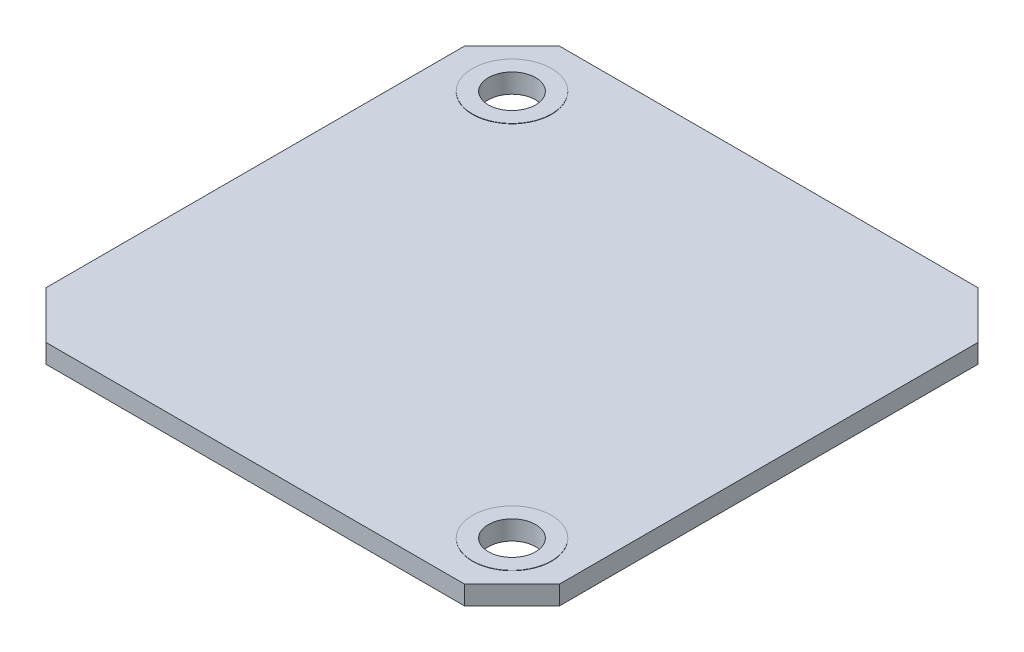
ISO-10303-21;
HEADER;
FILE_DESCRIPTION(('STEP AP214'),'2;1');
FILE_NAME('part.step','',(''),(''),'','','');
FILE_SCHEMA(('AUTOMOTIVE_DESIGN { 1 0 10303 214 1 1 1 1 }'));
ENDSEC;
DATA;
#1=APPLICATION_CONTEXT('core data for automotive mechanical design processes');
#2=APPLICATION_PROTOCOL_DEFINITION('international standard','automotive_design',2000,#1);
#3=PRODUCT_CONTEXT('',#1,'mechanical');
#4=PRODUCT('Part','Part','',(#3));
#5=PRODUCT_RELATED_PRODUCT_CATEGORY('part','',(#4));
#6=PRODUCT_DEFINITION_FORMATION('','',#4);
#7=PRODUCT_DEFINITION_CONTEXT('part definition',#1,'design');
#8=PRODUCT_DEFINITION('design','',#6,#7);
#9=PRODUCT_DEFINITION_SHAPE('','',#8);
#10=(LENGTH_UNIT() NAMED_UNIT(*) SI_UNIT(.MILLI.,.METRE.));
#11=(NAMED_UNIT(*) PLANE_ANGLE_UNIT() SI_UNIT($,.RADIAN.));
#12=(NAMED_UNIT(*) SI_UNIT($,.STERADIAN.) SOLID_ANGLE_UNIT());
#13=UNCERTAINTY_MEASURE_WITH_UNIT(LENGTH_MEASURE(1.E-05),#10,'distance_accuracy_value','');
#14=(GEOMETRIC_REPRESENTATION_CONTEXT(3) GLOBAL_UNCERTAINTY_ASSIGNED_CONTEXT((#13)) GLOBAL_UNIT_ASSIGNED_CONTEXT((#10,
#11,#12)) REPRESENTATION_CONTEXT('',''));
#15=CARTESIAN_POINT('',(0.,0.,0.));
#16=DIRECTION('',(0.,0.,1.));
#17=DIRECTION('',(1.,0.,0.));
#18=AXIS2_PLACEMENT_3D('',#15,#16,#17);
#19=CARTESIAN_POINT('',(5.08,1.524,-36.195));
#20=DIRECTION('',(0.,1.,0.));
#21=DIRECTION('',(0.,0.,1.));
#22=AXIS2_PLACEMENT_3D('',#19,#20,#21);
#23=CYLINDRICAL_SURFACE('',#22,3.175);
#24=CARTESIAN_POINT('',(5.08,1.5494,-36.195));
#25=DIRECTION('',(0.,1.,0.));
#26=DIRECTION('',(0.,0.,1.));
#27=AXIS2_PLACEMENT_3D('',#24,#25,#26);
#28=CIRCLE('',#27,3.175);
#29=CARTESIAN_POINT('',(5.08,1.5494,-33.02));
#30=VERTEX_POINT('',#29);
#31=EDGE_CURVE('E133',#30,#30,#28,.T.);
#32=ORIENTED_EDGE('',*,*,#31,.F.);
#33=EDGE_LOOP('',(#32));
#34=FACE_BOUND('',#33,.T.);
#35=CARTESIAN_POINT('',(5.08,1.524,-36.195));
#36=DIRECTION('',(0.,1.,0.));
#37=DIRECTION('',(0.,0.,1.));
#38=AXIS2_PLACEMENT_3D('',#35,#36,#37);
#39=CIRCLE('',#38,3.175);
#40=CARTESIAN_POINT('',(5.08,1.524,-33.02));
#41=VERTEX_POINT('',#40);
#42=EDGE_CURVE('E19',#41,#41,#39,.F.);
#43=ORIENTED_EDGE('',*,*,#42,.F.);
#44=EDGE_LOOP('',(#43));
#45=FACE_BOUND('',#44,.T.);
#46=ADVANCED_FACE('F15',(#34,#45),#23,.T.);
#47=CARTESIAN_POINT('',(36.195,1.524,-5.08));
#48=DIRECTION('',(0.,1.,0.));
#49=DIRECTION('',(0.,0.,1.));
#50=AXIS2_PLACEMENT_3D('',#47,#48,#49);
#51=CYLINDRICAL_SURFACE('',#50,3.175);
#52=CARTESIAN_POINT('',(36.195,1.5494,-5.08));
#53=DIRECTION('',(0.,1.,0.));
#54=DIRECTION('',(0.,0.,1.));
#55=AXIS2_PLACEMENT_3D('',#52,#53,#54);
#56=CIRCLE('',#55,3.175);
#57=CARTESIAN_POINT('',(36.195,1.5494,-1.905));
#58=VERTEX_POINT('',#57);
#59=EDGE_CURVE('E95',#58,#58,#56,.T.);
#60=ORIENTED_EDGE('',*,*,#59,.F.);
#61=EDGE_LOOP('',(#60));
#62=FACE_BOUND('',#61,.T.);
#63=CARTESIAN_POINT('',(36.195,1.524,-5.08));
#64=DIRECTION('',(0.,1.,0.));
#65=DIRECTION('',(0.,0.,1.));
#66=AXIS2_PLACEMENT_3D('',#63,#64,#65);
#67=CIRCLE('',#66,3.175);
#68=CARTESIAN_POINT('',(36.195,1.524,-1.905));
#69=VERTEX_POINT('',#68);
#70=EDGE_CURVE('E135',#69,#69,#67,.F.);
#71=ORIENTED_EDGE('',*,*,#70,.F.);
#72=EDGE_LOOP('',(#71));
#73=FACE_BOUND('',#72,.T.);
#74=ADVANCED_FACE('F144',(#62,#73),#51,.T.);
#75=CARTESIAN_POINT('',(-0.8255,1.524,0.8255));
#76=DIRECTION('',(0.,1.,0.));
#77=DIRECTION('',(1.,0.,0.));
#78=AXIS2_PLACEMENT_3D('',#75,#76,#77);
#79=PLANE('',#78);
#80=ORIENTED_EDGE('',*,*,#70,.T.);
#81=EDGE_LOOP('',(#80));
#82=FACE_BOUND('',#81,.T.);
#83=ORIENTED_EDGE('',*,*,#42,.T.);
#84=EDGE_LOOP('',(#83));
#85=FACE_BOUND('',#84,.T.);
#86=DIRECTION('',(-0.707106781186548,0.,0.707106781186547));
#87=VECTOR('',#86,1.);
#88=CARTESIAN_POINT('',(39.37,1.524,-1.905));
#89=LINE('',#88,#87);
#90=CARTESIAN_POINT('',(41.2750000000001,1.524,-3.81000000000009));
#91=VERTEX_POINT('',#90);
#92=CARTESIAN_POINT('',(37.4649999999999,1.524,0.));
#93=VERTEX_POINT('',#92);
#94=EDGE_CURVE('E382',#91,#93,#89,.T.);
#95=ORIENTED_EDGE('',*,*,#94,.F.);
#96=DIRECTION('',(0.,0.,1.));
#97=VECTOR('',#96,1.);
#98=CARTESIAN_POINT('',(41.275,1.524,-20.6375));
#99=LINE('',#98,#97);
#100=CARTESIAN_POINT('',(41.2750000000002,1.524,-37.4649999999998));
#101=VERTEX_POINT('',#100);
#102=EDGE_CURVE('E64',#101,#91,#99,.T.);
#103=ORIENTED_EDGE('',*,*,#102,.F.);
#104=DIRECTION('',(0.707106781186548,0.,0.707106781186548));
#105=VECTOR('',#104,1.);
#106=CARTESIAN_POINT('',(39.37,1.524,-39.37));
#107=LINE('',#106,#105);
#108=CARTESIAN_POINT('',(37.4649999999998,1.524,-41.2750000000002));
#109=VERTEX_POINT('',#108);
#110=EDGE_CURVE('E87',#109,#101,#107,.T.);
#111=ORIENTED_EDGE('',*,*,#110,.F.);
#112=DIRECTION('',(1.,0.,0.));
#113=VECTOR('',#112,1.);
#114=CARTESIAN_POINT('',(20.6375,1.524,-41.275));
#115=LINE('',#114,#113);
#116=CARTESIAN_POINT('',(3.81000000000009,1.524,-41.2750000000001));
#117=VERTEX_POINT('',#116);
#118=EDGE_CURVE('E90',#117,#109,#115,.T.);
#119=ORIENTED_EDGE('',*,*,#118,.F.);
#120=DIRECTION('',(0.707106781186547,0.,-0.707106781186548));
#121=VECTOR('',#120,1.);
#122=CARTESIAN_POINT('',(1.905,1.524,-39.37));
#123=LINE('',#122,#121);
#124=CARTESIAN_POINT('',(-1.73133534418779E-13,1.524,-37.4649999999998));
#125=VERTEX_POINT('',#124);
#126=EDGE_CURVE('E101',#125,#117,#123,.T.);
#127=ORIENTED_EDGE('',*,*,#126,.F.);
#128=DIRECTION('',(0.,0.,-1.));
#129=VECTOR('',#128,1.);
#130=CARTESIAN_POINT('',(0.,1.524,-20.6375));
#131=LINE('',#130,#129);
#132=CARTESIAN_POINT('',(0.,1.524,-3.81000000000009));
#133=VERTEX_POINT('',#132);
#134=EDGE_CURVE('E193',#133,#125,#131,.T.);
#135=ORIENTED_EDGE('',*,*,#134,.F.);
#136=DIRECTION('',(-0.707106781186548,0.,-0.707106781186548));
#137=VECTOR('',#136,1.);
#138=CARTESIAN_POINT('',(1.905,1.524,-1.905));
#139=LINE('',#138,#137);
#140=CARTESIAN_POINT('',(3.81000000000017,1.524,1.72618538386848E-13));
#141=VERTEX_POINT('',#140);
#142=EDGE_CURVE('E186',#141,#133,#139,.T.);
#143=ORIENTED_EDGE('',*,*,#142,.F.);
#144=DIRECTION('',(-1.,0.,0.));
#145=VECTOR('',#144,1.);
#146=CARTESIAN_POINT('',(20.6375,1.524,0.));
#147=LINE('',#146,#145);
#148=EDGE_CURVE('E190',#93,#141,#147,.T.);
#149=ORIENTED_EDGE('',*,*,#148,.F.);
#150=EDGE_LOOP('',(#95,#103,#111,#119,#127,#135,#143,#149));
#151=FACE_BOUND('',#150,.T.);
#152=ADVANCED_FACE('F89',(#82,#85,#151),#79,.T.);
#153=CARTESIAN_POINT('',(1.1557,1.5494,-1.1557));
#154=DIRECTION('',(0.,1.,0.));
#155=DIRECTION('',(1.,0.,0.));
#156=AXIS2_PLACEMENT_3D('',#153,#154,#155);
#157=PLANE('',#156);
#158=CARTESIAN_POINT('',(5.08,1.54939999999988,-36.195));
#159=DIRECTION('',(0.,1.,0.));
#160=DIRECTION('',(0.,0.,1.));
#161=AXIS2_PLACEMENT_3D('',#158,#159,#160);
#162=CIRCLE('',#161,1.89917725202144);
#163=CARTESIAN_POINT('',(5.08,1.54939999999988,-34.2958227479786));
#164=VERTEX_POINT('',#163);
#165=EDGE_CURVE('E128',#164,#164,#162,.T.);
#166=ORIENTED_EDGE('',*,*,#165,.F.);
#167=EDGE_LOOP('',(#166));
#168=FACE_BOUND('',#167,.T.);
#169=ORIENTED_EDGE('',*,*,#31,.T.);
#170=EDGE_LOOP('',(#169));
#171=FACE_BOUND('',#170,.T.);
#172=ADVANCED_FACE('F235',(#168,#171),#157,.T.);
#173=CARTESIAN_POINT('',(1.1557,1.5494,-1.1557));
#174=DIRECTION('',(0.,1.,0.));
#175=DIRECTION('',(1.,0.,0.));
#176=AXIS2_PLACEMENT_3D('',#173,#174,#175);
#177=PLANE('',#176);
#178=CARTESIAN_POINT('',(36.195,1.54939999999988,-5.08));
#179=DIRECTION('',(0.,1.,0.));
#180=DIRECTION('',(0.,0.,1.));
#181=AXIS2_PLACEMENT_3D('',#178,#179,#180);
#182=CIRCLE('',#181,1.8991772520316);
#183=CARTESIAN_POINT('',(36.195,1.54939999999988,-3.1808227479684));
#184=VERTEX_POINT('',#183);
#185=EDGE_CURVE('E125',#184,#184,#182,.T.);
#186=ORIENTED_EDGE('',*,*,#185,.F.);
#187=EDGE_LOOP('',(#186));
#188=FACE_BOUND('',#187,.T.);
#189=ORIENTED_EDGE('',*,*,#59,.T.);
#190=EDGE_LOOP('',(#189));
#191=FACE_BOUND('',#190,.T.);
#192=ADVANCED_FACE('F238',(#188,#191),#177,.T.);
#193=CARTESIAN_POINT('',(37.3888,1.59407066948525,-41.3512));
#194=DIRECTION('',(0.707106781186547,0.,-0.707106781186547));
#195=DIRECTION('',(0.707106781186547,0.,0.707106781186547));
#196=AXIS2_PLACEMENT_3D('',#193,#194,#195);
#197=PLANE('',#196);
#198=ORIENTED_EDGE('',*,*,#110,.T.);
#199=DIRECTION('',(0.,1.,0.));
#200=VECTOR('',#199,1.);
#201=CARTESIAN_POINT('',(41.275,0.761999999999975,-37.465));
#202=LINE('',#201,#200);
#203=CARTESIAN_POINT('',(41.275,0.,-37.465));
#204=VERTEX_POINT('',#203);
#205=EDGE_CURVE('E106',#204,#101,#202,.T.);
#206=ORIENTED_EDGE('',*,*,#205,.F.);
#207=DIRECTION('',(0.707106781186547,0.,0.707106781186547));
#208=VECTOR('',#207,1.);
#209=CARTESIAN_POINT('',(37.3888,0.,-41.3512));
#210=LINE('',#209,#208);
#211=CARTESIAN_POINT('',(37.465,0.,-41.275));
#212=VERTEX_POINT('',#211);
#213=EDGE_CURVE('E57',#204,#212,#210,.F.);
#214=ORIENTED_EDGE('',*,*,#213,.T.);
#215=DIRECTION('',(0.,-1.,0.));
#216=VECTOR('',#215,1.);
#217=CARTESIAN_POINT('',(37.465,0.761999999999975,-41.275));
#218=LINE('',#217,#216);
#219=EDGE_CURVE('E94',#109,#212,#218,.T.);
#220=ORIENTED_EDGE('',*,*,#219,.F.);
#221=EDGE_LOOP('',(#198,#206,#214,#220));
#222=FACE_BOUND('',#221,.T.);
#223=ADVANCED_FACE('F103',(#222),#197,.T.);
#224=CARTESIAN_POINT('',(38.1381,-0.0700706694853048,-41.275));
#225=DIRECTION('',(0.,0.,-1.));
#226=DIRECTION('',(-1.,0.,0.));
#227=AXIS2_PLACEMENT_3D('',#224,#225,#226);
#228=PLANE('',#227);
#229=DIRECTION('',(0.,-1.,0.));
#230=VECTOR('',#229,1.);
#231=CARTESIAN_POINT('',(3.81000000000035,0.761999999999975,-41.2750000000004));
#232=LINE('',#231,#230);
#233=CARTESIAN_POINT('',(3.81000000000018,0.,-41.2750000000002));
#234=VERTEX_POINT('',#233);
#235=EDGE_CURVE('E100',#117,#234,#232,.T.);
#236=ORIENTED_EDGE('',*,*,#235,.F.);
#237=ORIENTED_EDGE('',*,*,#118,.T.);
#238=ORIENTED_EDGE('',*,*,#219,.T.);
#239=DIRECTION('',(-1.,0.,0.));
#240=VECTOR('',#239,1.);
#241=CARTESIAN_POINT('',(20.6375,0.,-41.275));
#242=LINE('',#241,#240);
#243=EDGE_CURVE('E123',#212,#234,#242,.T.);
#244=ORIENTED_EDGE('',*,*,#243,.T.);
#245=EDGE_LOOP('',(#236,#237,#238,#244));
#246=FACE_BOUND('',#245,.T.);
#247=ADVANCED_FACE('F98',(#246),#228,.T.);
#248=CARTESIAN_POINT('',(-0.0762,1.59407066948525,-37.3888));
#249=DIRECTION('',(-0.707106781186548,0.,-0.707106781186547));
#250=DIRECTION('',(0.707106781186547,0.,-0.707106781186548));
#251=AXIS2_PLACEMENT_3D('',#248,#249,#250);
#252=PLANE('',#251);
#253=ORIENTED_EDGE('',*,*,#126,.T.);
#254=ORIENTED_EDGE('',*,*,#235,.T.);
#255=DIRECTION('',(0.707106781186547,0.,-0.707106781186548));
#256=VECTOR('',#255,1.);
#257=CARTESIAN_POINT('',(-0.0762,0.,-37.3888));
#258=LINE('',#257,#256);
#259=CARTESIAN_POINT('',(0.,0.,-37.465));
#260=VERTEX_POINT('',#259);
#261=EDGE_CURVE('E120',#234,#260,#258,.F.);
#262=ORIENTED_EDGE('',*,*,#261,.T.);
#263=DIRECTION('',(0.,-1.,0.));
#264=VECTOR('',#263,1.);
#265=CARTESIAN_POINT('',(0.,0.761999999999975,-37.465));
#266=LINE('',#265,#264);
#267=EDGE_CURVE('E192',#125,#260,#266,.T.);
#268=ORIENTED_EDGE('',*,*,#267,.F.);
#269=EDGE_LOOP('',(#253,#254,#262,#268));
#270=FACE_BOUND('',#269,.T.);
#271=ADVANCED_FACE('F205',(#270),#252,.T.);
#272=CARTESIAN_POINT('',(0.,-0.0700706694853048,-38.1381));
#273=DIRECTION('',(-1.,0.,0.));
#274=DIRECTION('',(0.,0.,1.));
#275=AXIS2_PLACEMENT_3D('',#272,#273,#274);
#276=PLANE('',#275);
#277=DIRECTION('',(0.,-1.,0.));
#278=VECTOR('',#277,1.);
#279=CARTESIAN_POINT('',(-3.4515576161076E-13,0.761999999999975,-3.81000000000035));
#280=LINE('',#279,#278);
#281=CARTESIAN_POINT('',(-1.7213064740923E-13,0.,-3.81000000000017));
#282=VERTEX_POINT('',#281);
#283=EDGE_CURVE('E184',#133,#282,#280,.T.);
#284=ORIENTED_EDGE('',*,*,#283,.F.);
#285=ORIENTED_EDGE('',*,*,#134,.T.);
#286=ORIENTED_EDGE('',*,*,#267,.T.);
#287=DIRECTION('',(0.,0.,1.));
#288=VECTOR('',#287,1.);
#289=CARTESIAN_POINT('',(0.,0.,-20.6375));
#290=LINE('',#289,#288);
#291=EDGE_CURVE('E119',#260,#282,#290,.T.);
#292=ORIENTED_EDGE('',*,*,#291,.T.);
#293=EDGE_LOOP('',(#284,#285,#286,#292));
#294=FACE_BOUND('',#293,.T.);
#295=ADVANCED_FACE('F208',(#294),#276,.T.);
#296=CARTESIAN_POINT('',(3.8862,1.59407066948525,0.0762));
#297=DIRECTION('',(-0.707106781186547,0.,0.707106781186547));
#298=DIRECTION('',(-0.707106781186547,0.,-0.707106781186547));
#299=AXIS2_PLACEMENT_3D('',#296,#297,#298);
#300=PLANE('',#299);
#301=ORIENTED_EDGE('',*,*,#142,.T.);
#302=ORIENTED_EDGE('',*,*,#283,.T.);
#303=DIRECTION('',(-0.707106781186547,0.,-0.707106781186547));
#304=VECTOR('',#303,1.);
#305=CARTESIAN_POINT('',(3.8862,0.,0.0762));
#306=LINE('',#305,#304);
#307=CARTESIAN_POINT('',(3.81,0.,0.));
#308=VERTEX_POINT('',#307);
#309=EDGE_CURVE('E116',#282,#308,#306,.F.);
#310=ORIENTED_EDGE('',*,*,#309,.T.);
#311=DIRECTION('',(0.,-1.,0.));
#312=VECTOR('',#311,1.);
#313=CARTESIAN_POINT('',(3.81,0.761999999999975,0.));
#314=LINE('',#313,#312);
#315=EDGE_CURVE('E178',#141,#308,#314,.T.);
#316=ORIENTED_EDGE('',*,*,#315,.F.);
#317=EDGE_LOOP('',(#301,#302,#310,#316));
#318=FACE_BOUND('',#317,.T.);
#319=ADVANCED_FACE('F210',(#318),#300,.T.);
#320=CARTESIAN_POINT('',(3.1369,-0.0700706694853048,0.));
#321=DIRECTION('',(0.,0.,1.));
#322=DIRECTION('',(1.,0.,0.));
#323=AXIS2_PLACEMENT_3D('',#320,#321,#322);
#324=PLANE('',#323);
#325=DIRECTION('',(0.,-1.,0.));
#326=VECTOR('',#325,1.);
#327=CARTESIAN_POINT('',(37.4649999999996,0.761999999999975,3.4515576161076E-13));
#328=LINE('',#327,#326);
#329=CARTESIAN_POINT('',(37.4649999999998,0.,1.72998009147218E-13));
#330=VERTEX_POINT('',#329);
#331=EDGE_CURVE('E176',#93,#330,#328,.T.);
#332=ORIENTED_EDGE('',*,*,#331,.F.);
#333=ORIENTED_EDGE('',*,*,#148,.T.);
#334=ORIENTED_EDGE('',*,*,#315,.T.);
#335=DIRECTION('',(1.,0.,0.));
#336=VECTOR('',#335,1.);
#337=CARTESIAN_POINT('',(20.6375,0.,0.));
#338=LINE('',#337,#336);
#339=EDGE_CURVE('E115',#308,#330,#338,.T.);
#340=ORIENTED_EDGE('',*,*,#339,.T.);
#341=EDGE_LOOP('',(#332,#333,#334,#340));
#342=FACE_BOUND('',#341,.T.);
#343=ADVANCED_FACE('F174',(#342),#324,.T.);
#344=CARTESIAN_POINT('',(41.3512,1.59407066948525,-3.8862));
#345=DIRECTION('',(0.707106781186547,0.,0.707106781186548));
#346=DIRECTION('',(-0.707106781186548,0.,0.707106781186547));
#347=AXIS2_PLACEMENT_3D('',#344,#345,#346);
#348=PLANE('',#347);
#349=ORIENTED_EDGE('',*,*,#94,.T.);
#350=ORIENTED_EDGE('',*,*,#331,.T.);
#351=DIRECTION('',(-0.707106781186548,0.,0.707106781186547));
#352=VECTOR('',#351,1.);
#353=CARTESIAN_POINT('',(41.3512,0.,-3.8862));
#354=LINE('',#353,#352);
#355=CARTESIAN_POINT('',(41.275,0.,-3.81));
#356=VERTEX_POINT('',#355);
#357=EDGE_CURVE('E112',#330,#356,#354,.F.);
#358=ORIENTED_EDGE('',*,*,#357,.T.);
#359=DIRECTION('',(0.,-1.,0.));
#360=VECTOR('',#359,1.);
#361=CARTESIAN_POINT('',(41.275,0.761999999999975,-3.81));
#362=LINE('',#361,#360);
#363=EDGE_CURVE('E34',#91,#356,#362,.T.);
#364=ORIENTED_EDGE('',*,*,#363,.F.);
#365=EDGE_LOOP('',(#349,#350,#358,#364));
#366=FACE_BOUND('',#365,.T.);
#367=ADVANCED_FACE('F217',(#366),#348,.T.);
#368=CARTESIAN_POINT('',(41.275,-0.0700706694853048,-3.1369));
#369=DIRECTION('',(1.,0.,0.));
#370=DIRECTION('',(0.,0.,-1.));
#371=AXIS2_PLACEMENT_3D('',#368,#369,#370);
#372=PLANE('',#371);
#373=ORIENTED_EDGE('',*,*,#363,.T.);
#374=DIRECTION('',(0.,0.,-1.));
#375=VECTOR('',#374,1.);
#376=CARTESIAN_POINT('',(41.275,0.,-20.6375));
#377=LINE('',#376,#375);
#378=EDGE_CURVE('E111',#356,#204,#377,.T.);
#379=ORIENTED_EDGE('',*,*,#378,.T.);
#380=ORIENTED_EDGE('',*,*,#205,.T.);
#381=ORIENTED_EDGE('',*,*,#102,.T.);
#382=EDGE_LOOP('',(#373,#379,#380,#381));
#383=FACE_BOUND('',#382,.T.);
#384=ADVANCED_FACE('F223',(#383),#372,.T.);
#385=CARTESIAN_POINT('',(5.08,0.,-36.195));
#386=DIRECTION('',(0.,1.,0.));
#387=DIRECTION('',(0.,0.,1.));
#388=AXIS2_PLACEMENT_3D('',#385,#386,#387);
#389=CYLINDRICAL_SURFACE('',#388,1.89917725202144);
#390=CARTESIAN_POINT('',(5.08,0.,-36.195));
#391=DIRECTION('',(0.,1.,0.));
#392=DIRECTION('',(0.,0.,1.));
#393=AXIS2_PLACEMENT_3D('',#390,#391,#392);
#394=CIRCLE('',#393,1.89917725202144);
#395=CARTESIAN_POINT('',(5.08,0.,-34.2958227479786));
#396=VERTEX_POINT('',#395);
#397=EDGE_CURVE('E25',#396,#396,#394,.F.);
#398=ORIENTED_EDGE('',*,*,#397,.T.);
#399=EDGE_LOOP('',(#398));
#400=FACE_BOUND('',#399,.T.);
#401=ORIENTED_EDGE('',*,*,#165,.T.);
#402=EDGE_LOOP('',(#401));
#403=FACE_BOUND('',#402,.T.);
#404=ADVANCED_FACE('F161',(#400,#403),#389,.F.);
#405=CARTESIAN_POINT('',(36.195,0.,-5.08));
#406=DIRECTION('',(0.,1.,0.));
#407=DIRECTION('',(0.,0.,1.));
#408=AXIS2_PLACEMENT_3D('',#405,#406,#407);
#409=CYLINDRICAL_SURFACE('',#408,1.8991772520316);
#410=CARTESIAN_POINT('',(36.195,0.,-5.08));
#411=DIRECTION('',(0.,1.,0.));
#412=DIRECTION('',(0.,0.,1.));
#413=AXIS2_PLACEMENT_3D('',#410,#411,#412);
#414=CIRCLE('',#413,1.8991772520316);
#415=CARTESIAN_POINT('',(36.195,0.,-3.1808227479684));
#416=VERTEX_POINT('',#415);
#417=EDGE_CURVE('E10',#416,#416,#414,.F.);
#418=ORIENTED_EDGE('',*,*,#417,.T.);
#419=EDGE_LOOP('',(#418));
#420=FACE_BOUND('',#419,.T.);
#421=ORIENTED_EDGE('',*,*,#185,.T.);
#422=EDGE_LOOP('',(#421));
#423=FACE_BOUND('',#422,.T.);
#424=ADVANCED_FACE('F156',(#420,#423),#409,.F.);
#425=CARTESIAN_POINT('',(-0.8255,0.,0.8255));
#426=DIRECTION('',(0.,1.,0.));
#427=DIRECTION('',(1.,0.,0.));
#428=AXIS2_PLACEMENT_3D('',#425,#426,#427);
#429=PLANE('',#428);
#430=ORIENTED_EDGE('',*,*,#417,.F.);
#431=EDGE_LOOP('',(#430));
#432=FACE_BOUND('',#431,.T.);
#433=ORIENTED_EDGE('',*,*,#397,.F.);
#434=EDGE_LOOP('',(#433));
#435=FACE_BOUND('',#434,.T.);
#436=ORIENTED_EDGE('',*,*,#357,.F.);
#437=ORIENTED_EDGE('',*,*,#339,.F.);
#438=ORIENTED_EDGE('',*,*,#309,.F.);
#439=ORIENTED_EDGE('',*,*,#291,.F.);
#440=ORIENTED_EDGE('',*,*,#261,.F.);
#441=ORIENTED_EDGE('',*,*,#243,.F.);
#442=ORIENTED_EDGE('',*,*,#213,.F.);
#443=ORIENTED_EDGE('',*,*,#378,.F.);
#444=EDGE_LOOP('',(#436,#437,#438,#439,#440,#441,#442,#443));
#445=FACE_BOUND('',#444,.T.);
#446=ADVANCED_FACE('F17',(#432,#435,#445),#429,.F.);
#447=CLOSED_SHELL('',(#46,#74,#152,#172,#192,#223,#247,#271,#295,#319,#343,#367,#384,#404,#424,#446));
#448=MANIFOLD_SOLID_BREP('B1',#447);
#449=ADVANCED_BREP_SHAPE_REPRESENTATION('',(#18,#448),#14);
#450=SHAPE_DEFINITION_REPRESENTATION(#9,#449);
ENDSEC;
END-ISO-10303-21;
